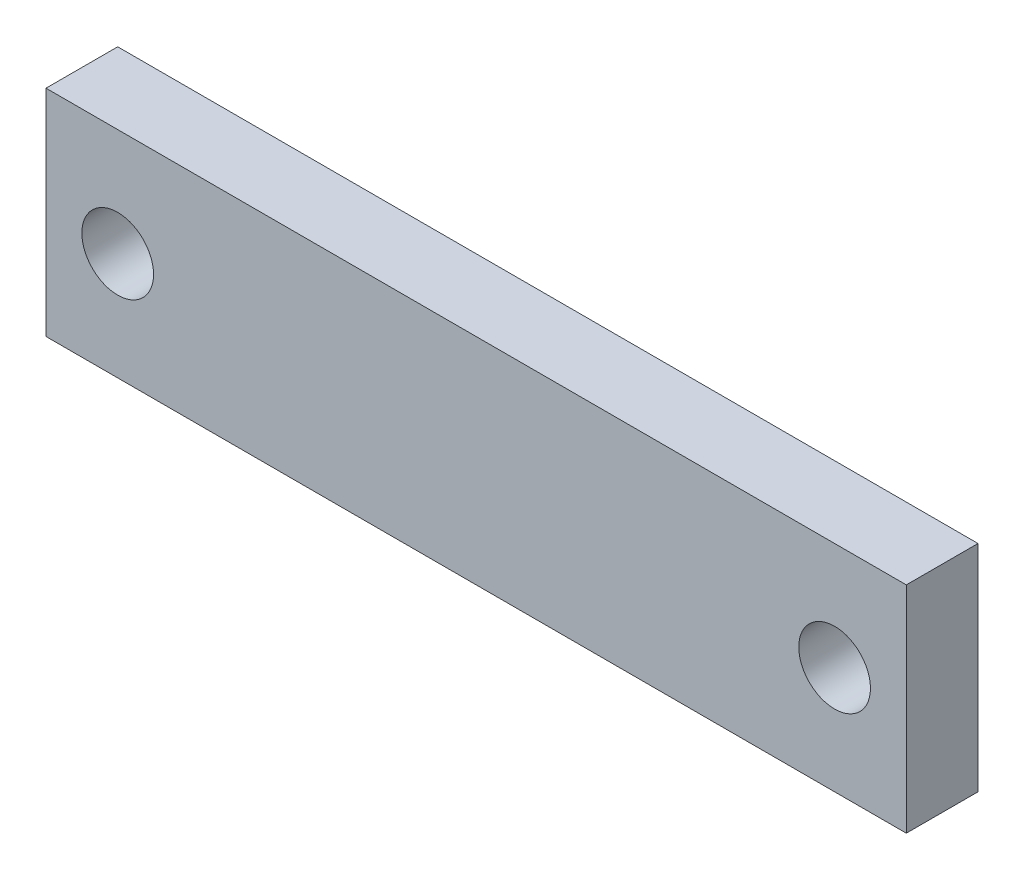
from build123d import *

# Parameters (mm, degrees)
SKIZZE1_W               = 120
SKIZZE1_H               = 30
SKIZZE1_R               = 5
LINEAR_AUSTRAGEN1_DEPTH = 10


with BuildPart() as part:
    # Skizze1 → Linear austragen1 (new body)
    with BuildSketch(Plane.XY):
        with Locations((-40, 15)):
            Rectangle(SKIZZE1_W, SKIZZE1_H)
        with Locations((-90, 15)):
            Circle(SKIZZE1_R, mode=Mode.SUBTRACT)
        with Locations((10, 15)):
            Circle(SKIZZE1_R, mode=Mode.SUBTRACT)
    extrude(amount=LINEAR_AUSTRAGEN1_DEPTH)


solid = part.part
